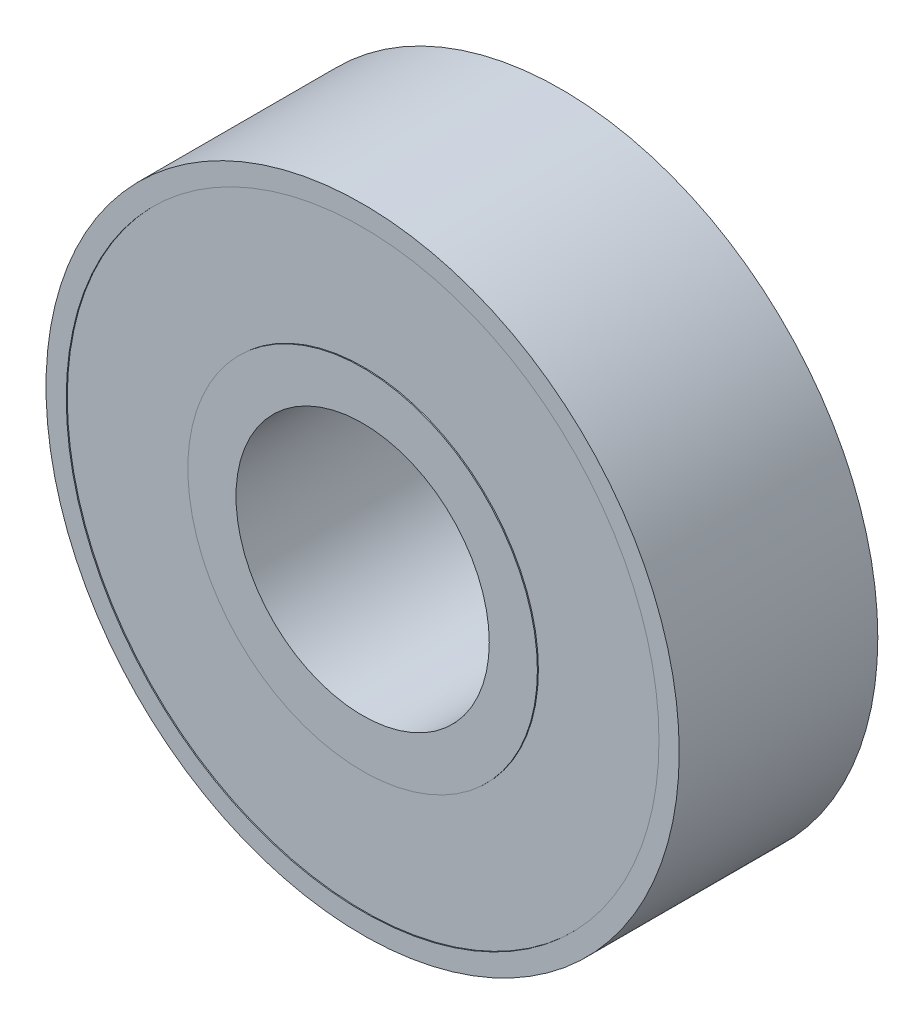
ISO-10303-21;
HEADER;
FILE_DESCRIPTION(('STEP AP214'),'2;1');
FILE_NAME('part.step','',(''),(''),'','','');
FILE_SCHEMA(('AUTOMOTIVE_DESIGN { 1 0 10303 214 1 1 1 1 }'));
ENDSEC;
DATA;
#1=APPLICATION_CONTEXT('core data for automotive mechanical design processes');
#2=APPLICATION_PROTOCOL_DEFINITION('international standard','automotive_design',2000,#1);
#3=PRODUCT_CONTEXT('',#1,'mechanical');
#4=PRODUCT('Part','Part','',(#3));
#5=PRODUCT_RELATED_PRODUCT_CATEGORY('part','',(#4));
#6=PRODUCT_DEFINITION_FORMATION('','',#4);
#7=PRODUCT_DEFINITION_CONTEXT('part definition',#1,'design');
#8=PRODUCT_DEFINITION('design','',#6,#7);
#9=PRODUCT_DEFINITION_SHAPE('','',#8);
#10=(LENGTH_UNIT() NAMED_UNIT(*) SI_UNIT(.MILLI.,.METRE.));
#11=(NAMED_UNIT(*) PLANE_ANGLE_UNIT() SI_UNIT($,.RADIAN.));
#12=(NAMED_UNIT(*) SI_UNIT($,.STERADIAN.) SOLID_ANGLE_UNIT());
#13=UNCERTAINTY_MEASURE_WITH_UNIT(LENGTH_MEASURE(1.E-05),#10,'distance_accuracy_value','');
#14=(GEOMETRIC_REPRESENTATION_CONTEXT(3) GLOBAL_UNCERTAINTY_ASSIGNED_CONTEXT((#13)) GLOBAL_UNIT_ASSIGNED_CONTEXT((#10,
#11,#12)) REPRESENTATION_CONTEXT('',''));
#15=CARTESIAN_POINT('',(0.,0.,0.));
#16=DIRECTION('',(0.,0.,1.));
#17=DIRECTION('',(1.,0.,0.));
#18=AXIS2_PLACEMENT_3D('',#15,#16,#17);
#19=CARTESIAN_POINT('',(0.,0.,-2.4892));
#20=DIRECTION('',(0.,0.,1.));
#21=DIRECTION('',(1.,0.,0.));
#22=AXIS2_PLACEMENT_3D('',#19,#20,#21);
#23=PLANE('',#22);
#24=CARTESIAN_POINT('',(0.,0.,-2.4892));
#25=DIRECTION('',(0.,0.,1.));
#26=DIRECTION('',(1.,0.,0.));
#27=AXIS2_PLACEMENT_3D('',#24,#25,#26);
#28=CIRCLE('',#27,3.175);
#29=CARTESIAN_POINT('',(3.175,0.,-2.4892));
#30=VERTEX_POINT('',#29);
#31=EDGE_CURVE('E46',#30,#30,#28,.T.);
#32=ORIENTED_EDGE('',*,*,#31,.T.);
#33=EDGE_LOOP('',(#32));
#34=FACE_BOUND('',#33,.T.);
#35=CARTESIAN_POINT('',(0.,0.,-2.4892));
#36=DIRECTION('',(0.,0.,1.));
#37=DIRECTION('',(1.,0.,0.));
#38=AXIS2_PLACEMENT_3D('',#35,#36,#37);
#39=CIRCLE('',#38,4.3815);
#40=CARTESIAN_POINT('',(4.3815,0.,-2.4892));
#41=VERTEX_POINT('',#40);
#42=EDGE_CURVE('E70',#41,#41,#39,.T.);
#43=ORIENTED_EDGE('',*,*,#42,.F.);
#44=EDGE_LOOP('',(#43));
#45=FACE_BOUND('',#44,.T.);
#46=ADVANCED_FACE('F33',(#34,#45),#23,.F.);
#47=CARTESIAN_POINT('',(0.,0.,2.4892));
#48=DIRECTION('',(0.,0.,1.));
#49=DIRECTION('',(1.,0.,0.));
#50=AXIS2_PLACEMENT_3D('',#47,#48,#49);
#51=PLANE('',#50);
#52=CARTESIAN_POINT('',(0.,0.,2.4892));
#53=DIRECTION('',(0.,0.,1.));
#54=DIRECTION('',(1.,0.,0.));
#55=AXIS2_PLACEMENT_3D('',#52,#53,#54);
#56=CIRCLE('',#55,3.175);
#57=CARTESIAN_POINT('',(3.175,0.,2.4892));
#58=VERTEX_POINT('',#57);
#59=EDGE_CURVE('E44',#58,#58,#56,.T.);
#60=ORIENTED_EDGE('',*,*,#59,.F.);
#61=EDGE_LOOP('',(#60));
#62=FACE_BOUND('',#61,.T.);
#63=CARTESIAN_POINT('',(0.,0.,2.4892));
#64=DIRECTION('',(0.,0.,1.));
#65=DIRECTION('',(1.,0.,0.));
#66=AXIS2_PLACEMENT_3D('',#63,#64,#65);
#67=CIRCLE('',#66,4.3815);
#68=CARTESIAN_POINT('',(4.3815,0.,2.4892));
#69=VERTEX_POINT('',#68);
#70=EDGE_CURVE('E58',#69,#69,#67,.T.);
#71=ORIENTED_EDGE('',*,*,#70,.T.);
#72=EDGE_LOOP('',(#71));
#73=FACE_BOUND('',#72,.T.);
#74=ADVANCED_FACE('F86',(#62,#73),#51,.T.);
#75=CARTESIAN_POINT('',(0.,0.,2.4892));
#76=DIRECTION('',(0.,0.,1.));
#77=DIRECTION('',(1.,0.,0.));
#78=AXIS2_PLACEMENT_3D('',#75,#76,#77);
#79=CIRCLE('',#78,7.4295);
#80=CARTESIAN_POINT('',(7.4295,0.,2.4892));
#81=VERTEX_POINT('',#80);
#82=EDGE_CURVE('E52',#81,#81,#79,.T.);
#83=ORIENTED_EDGE('',*,*,#82,.F.);
#84=EDGE_LOOP('',(#83));
#85=FACE_BOUND('',#84,.T.);
#86=CARTESIAN_POINT('',(0.,0.,2.4892));
#87=DIRECTION('',(0.,0.,1.));
#88=DIRECTION('',(1.,0.,0.));
#89=AXIS2_PLACEMENT_3D('',#86,#87,#88);
#90=CIRCLE('',#89,7.9375);
#91=CARTESIAN_POINT('',(7.9375,0.,2.4892));
#92=VERTEX_POINT('',#91);
#93=EDGE_CURVE('E10',#92,#92,#90,.T.);
#94=ORIENTED_EDGE('',*,*,#93,.T.);
#95=EDGE_LOOP('',(#94));
#96=FACE_BOUND('',#95,.T.);
#97=ADVANCED_FACE('F92',(#85,#96),#51,.T.);
#98=CARTESIAN_POINT('',(0.,0.,-2.4892));
#99=DIRECTION('',(0.,0.,1.));
#100=DIRECTION('',(1.,0.,0.));
#101=AXIS2_PLACEMENT_3D('',#98,#99,#100);
#102=CIRCLE('',#101,7.4295);
#103=CARTESIAN_POINT('',(7.4295,0.,-2.4892));
#104=VERTEX_POINT('',#103);
#105=EDGE_CURVE('E64',#104,#104,#102,.T.);
#106=ORIENTED_EDGE('',*,*,#105,.T.);
#107=EDGE_LOOP('',(#106));
#108=FACE_BOUND('',#107,.T.);
#109=CARTESIAN_POINT('',(0.,0.,-2.4892));
#110=DIRECTION('',(0.,0.,1.));
#111=DIRECTION('',(1.,0.,0.));
#112=AXIS2_PLACEMENT_3D('',#109,#110,#111);
#113=CIRCLE('',#112,7.9375);
#114=CARTESIAN_POINT('',(7.9375,0.,-2.4892));
#115=VERTEX_POINT('',#114);
#116=EDGE_CURVE('E37',#115,#115,#113,.T.);
#117=ORIENTED_EDGE('',*,*,#116,.F.);
#118=EDGE_LOOP('',(#117));
#119=FACE_BOUND('',#118,.T.);
#120=ADVANCED_FACE('F88',(#108,#119),#23,.F.);
#121=CARTESIAN_POINT('',(0.,0.,2.4892));
#122=DIRECTION('',(0.,0.,-1.));
#123=DIRECTION('',(-1.,0.,0.));
#124=AXIS2_PLACEMENT_3D('',#121,#122,#123);
#125=CYLINDRICAL_SURFACE('',#124,7.9375);
#126=ORIENTED_EDGE('',*,*,#93,.F.);
#127=EDGE_LOOP('',(#126));
#128=FACE_BOUND('',#127,.T.);
#129=ORIENTED_EDGE('',*,*,#116,.T.);
#130=EDGE_LOOP('',(#129));
#131=FACE_BOUND('',#130,.T.);
#132=ADVANCED_FACE('F35',(#128,#131),#125,.T.);
#133=CARTESIAN_POINT('',(0.,0.,2.4892));
#134=DIRECTION('',(0.,0.,-1.));
#135=DIRECTION('',(-1.,0.,0.));
#136=AXIS2_PLACEMENT_3D('',#133,#134,#135);
#137=CYLINDRICAL_SURFACE('',#136,3.175);
#138=ORIENTED_EDGE('',*,*,#59,.T.);
#139=EDGE_LOOP('',(#138));
#140=FACE_BOUND('',#139,.T.);
#141=ORIENTED_EDGE('',*,*,#31,.F.);
#142=EDGE_LOOP('',(#141));
#143=FACE_BOUND('',#142,.T.);
#144=ADVANCED_FACE('F101',(#140,#143),#137,.F.);
#145=CARTESIAN_POINT('',(0.,0.,2.4638));
#146=DIRECTION('',(0.,0.,1.));
#147=DIRECTION('',(1.,0.,0.));
#148=AXIS2_PLACEMENT_3D('',#145,#146,#147);
#149=CYLINDRICAL_SURFACE('',#148,7.4295);
#150=CARTESIAN_POINT('',(0.,0.,2.4638));
#151=DIRECTION('',(0.,0.,1.));
#152=DIRECTION('',(1.,0.,0.));
#153=AXIS2_PLACEMENT_3D('',#150,#151,#152);
#154=CIRCLE('',#153,7.4295);
#155=CARTESIAN_POINT('',(7.4295,0.,2.4638));
#156=VERTEX_POINT('',#155);
#157=EDGE_CURVE('E49',#156,#156,#154,.T.);
#158=ORIENTED_EDGE('',*,*,#157,.F.);
#159=EDGE_LOOP('',(#158));
#160=FACE_BOUND('',#159,.T.);
#161=ORIENTED_EDGE('',*,*,#82,.T.);
#162=EDGE_LOOP('',(#161));
#163=FACE_BOUND('',#162,.T.);
#164=ADVANCED_FACE('F125',(#160,#163),#149,.F.);
#165=CARTESIAN_POINT('',(0.,0.,2.4638));
#166=DIRECTION('',(0.,0.,1.));
#167=DIRECTION('',(1.,0.,0.));
#168=AXIS2_PLACEMENT_3D('',#165,#166,#167);
#169=PLANE('',#168);
#170=CARTESIAN_POINT('',(0.,0.,2.4638));
#171=DIRECTION('',(0.,0.,1.));
#172=DIRECTION('',(1.,0.,0.));
#173=AXIS2_PLACEMENT_3D('',#170,#171,#172);
#174=CIRCLE('',#173,4.3815);
#175=CARTESIAN_POINT('',(4.3815,0.,2.4638));
#176=VERTEX_POINT('',#175);
#177=EDGE_CURVE('E55',#176,#176,#174,.T.);
#178=ORIENTED_EDGE('',*,*,#177,.F.);
#179=EDGE_LOOP('',(#178));
#180=FACE_BOUND('',#179,.T.);
#181=ORIENTED_EDGE('',*,*,#157,.T.);
#182=EDGE_LOOP('',(#181));
#183=FACE_BOUND('',#182,.T.);
#184=ADVANCED_FACE('F121',(#180,#183),#169,.T.);
#185=CARTESIAN_POINT('',(0.,0.,2.4638));
#186=DIRECTION('',(0.,0.,1.));
#187=DIRECTION('',(1.,0.,0.));
#188=AXIS2_PLACEMENT_3D('',#185,#186,#187);
#189=CYLINDRICAL_SURFACE('',#188,4.3815);
#190=ORIENTED_EDGE('',*,*,#177,.T.);
#191=EDGE_LOOP('',(#190));
#192=FACE_BOUND('',#191,.T.);
#193=ORIENTED_EDGE('',*,*,#70,.F.);
#194=EDGE_LOOP('',(#193));
#195=FACE_BOUND('',#194,.T.);
#196=ADVANCED_FACE('F115',(#192,#195),#189,.T.);
#197=CARTESIAN_POINT('',(0.,0.,-2.4638));
#198=DIRECTION('',(0.,0.,-1.));
#199=DIRECTION('',(1.,0.,0.));
#200=AXIS2_PLACEMENT_3D('',#197,#198,#199);
#201=PLANE('',#200);
#202=CARTESIAN_POINT('',(0.,0.,-2.4638));
#203=DIRECTION('',(0.,0.,1.));
#204=DIRECTION('',(1.,0.,0.));
#205=AXIS2_PLACEMENT_3D('',#202,#203,#204);
#206=CIRCLE('',#205,7.4295);
#207=CARTESIAN_POINT('',(7.4295,0.,-2.4638));
#208=VERTEX_POINT('',#207);
#209=EDGE_CURVE('E61',#208,#208,#206,.T.);
#210=ORIENTED_EDGE('',*,*,#209,.F.);
#211=EDGE_LOOP('',(#210));
#212=FACE_BOUND('',#211,.T.);
#213=CARTESIAN_POINT('',(0.,0.,-2.4638));
#214=DIRECTION('',(0.,0.,1.));
#215=DIRECTION('',(1.,0.,0.));
#216=AXIS2_PLACEMENT_3D('',#213,#214,#215);
#217=CIRCLE('',#216,4.3815);
#218=CARTESIAN_POINT('',(4.3815,0.,-2.4638));
#219=VERTEX_POINT('',#218);
#220=EDGE_CURVE('E67',#219,#219,#217,.T.);
#221=ORIENTED_EDGE('',*,*,#220,.T.);
#222=EDGE_LOOP('',(#221));
#223=FACE_BOUND('',#222,.T.);
#224=ADVANCED_FACE('F76',(#212,#223),#201,.T.);
#225=CARTESIAN_POINT('',(0.,0.,-2.4638));
#226=DIRECTION('',(0.,0.,-1.));
#227=DIRECTION('',(-1.,0.,0.));
#228=AXIS2_PLACEMENT_3D('',#225,#226,#227);
#229=CYLINDRICAL_SURFACE('',#228,7.4295);
#230=ORIENTED_EDGE('',*,*,#209,.T.);
#231=EDGE_LOOP('',(#230));
#232=FACE_BOUND('',#231,.T.);
#233=ORIENTED_EDGE('',*,*,#105,.F.);
#234=EDGE_LOOP('',(#233));
#235=FACE_BOUND('',#234,.T.);
#236=ADVANCED_FACE('F81',(#232,#235),#229,.F.);
#237=CARTESIAN_POINT('',(0.,0.,-2.4638));
#238=DIRECTION('',(0.,0.,-1.));
#239=DIRECTION('',(-1.,0.,0.));
#240=AXIS2_PLACEMENT_3D('',#237,#238,#239);
#241=CYLINDRICAL_SURFACE('',#240,4.3815);
#242=ORIENTED_EDGE('',*,*,#220,.F.);
#243=EDGE_LOOP('',(#242));
#244=FACE_BOUND('',#243,.T.);
#245=ORIENTED_EDGE('',*,*,#42,.T.);
#246=EDGE_LOOP('',(#245));
#247=FACE_BOUND('',#246,.T.);
#248=ADVANCED_FACE('F78',(#244,#247),#241,.T.);
#249=CLOSED_SHELL('',(#46,#74,#97,#120,#132,#144,#164,#184,#196,#224,#236,#248));
#250=MANIFOLD_SOLID_BREP('B2',#249);
#251=ADVANCED_BREP_SHAPE_REPRESENTATION('',(#18,#250),#14);
#252=SHAPE_DEFINITION_REPRESENTATION(#9,#251);
ENDSEC;
END-ISO-10303-21;
